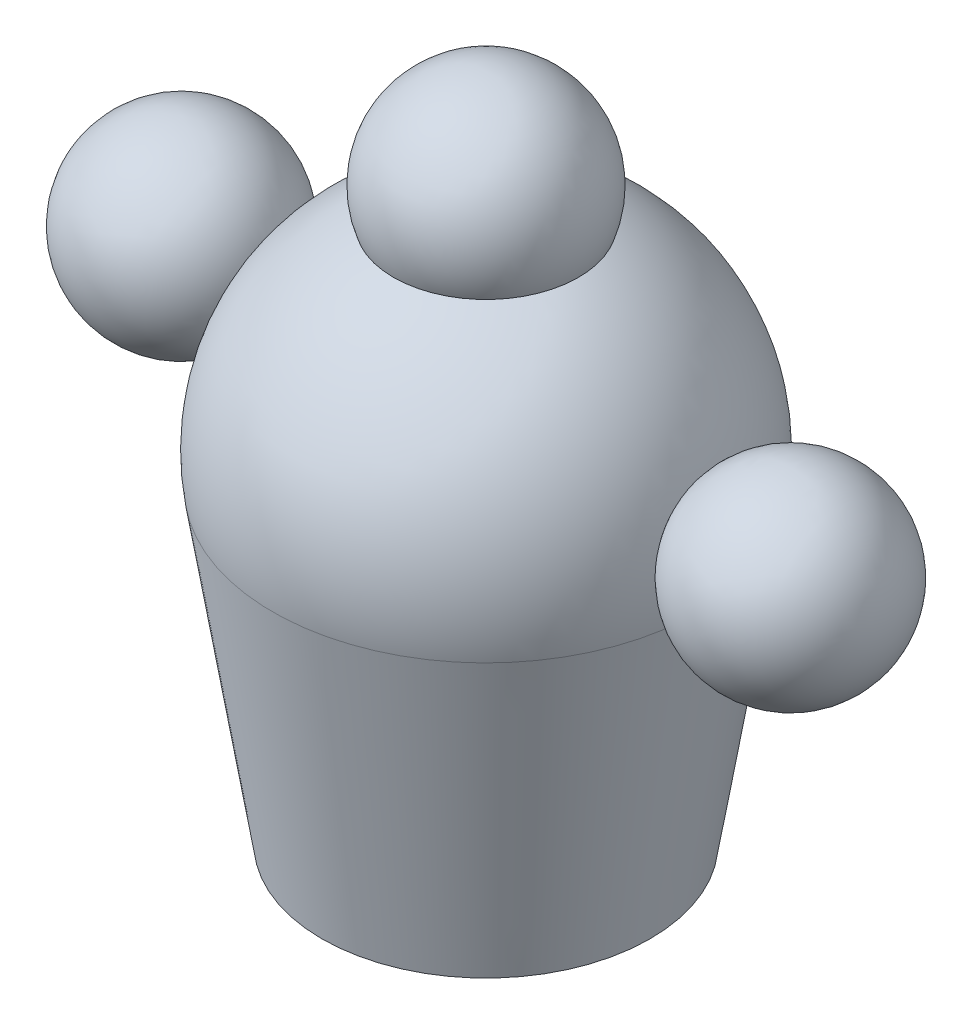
from build123d import *


with BuildPart() as part:
    # Skica1 → Oto_it kolem osy1 (revolve)
    with BuildSketch(Plane.XY):
        with BuildLine():
            Line((112.125, 161.764780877), (86.25, 0))
            Line((86.25, 0), (0, 0))
            Line((0, 0), (0, 293.25))
            ThreePointArc((0, 293.25), (86.400779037, 253.378583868), (112.125, 161.764780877))
        make_face()
    revolve(axis=Axis((0, 0, 0), (0, 1, 0)))

    # Skica7 → Odebrat oto_en_m1 (revolve, cut)
    with BuildSketch(Plane.XY, mode=Mode.PRIVATE) as odebrat_oto_en_m1_sk:
        with BuildLine():
            Line((0, 38.573518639), (0, 0))
            Line((0, 0), (-71.875, 0))
            ThreePointArc((-71.875, 0), (-40.785818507, 28.320752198), (0, 38.573518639))
        make_face()
    revolve(odebrat_oto_en_m1_sk.sketch.rotate(Axis((0, 38.573518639, 0), (0, -1, 0)), 90), axis=Axis((0, 38.573518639, 0), (0, -1, 0)), mode=Mode.SUBTRACT)

    # Odebrat povrchem3
    split(bisect_by=Plane.XY.offset(-90), keep=Keep.TOP)

    # Skica8 → Oto_it kolem osy3 (revolve)
    with BuildSketch(Plane(origin=(0, 201.25, 0), x_dir=(-1, 0, 0), z_dir=(0, 1, 0))):
        with BuildLine():
            Line((109.6875, 0), (210.3125, 0))
            ThreePointArc((210.3125, 0), (160, 50.3125), (109.6875, 0))
        make_face()
    oto_it_kolem_osy3 = revolve(axis=Axis((-109.6875, 201.25, 0), (-1, 0, 0)))

    # Zrcadlit2: Oto_it kolem osy3 across plane
    add(oto_it_kolem_osy3.mirror(Plane(origin=(0, 0, 0), x_dir=(0, 0, 1), z_dir=(1, 0, 0))))

    # Skica9 → Oto_it kolem osy4 (revolve)
    with BuildSketch(Plane.XY):
        with BuildLine():
            Line((0, 248.25), (0, 351.75))
            ThreePointArc((0, 351.75), (-51.75, 300), (0, 248.25))
        make_face()
    revolve(axis=Axis((0, 351.75, 0), (0, 1, 0)))


solid = part.part
